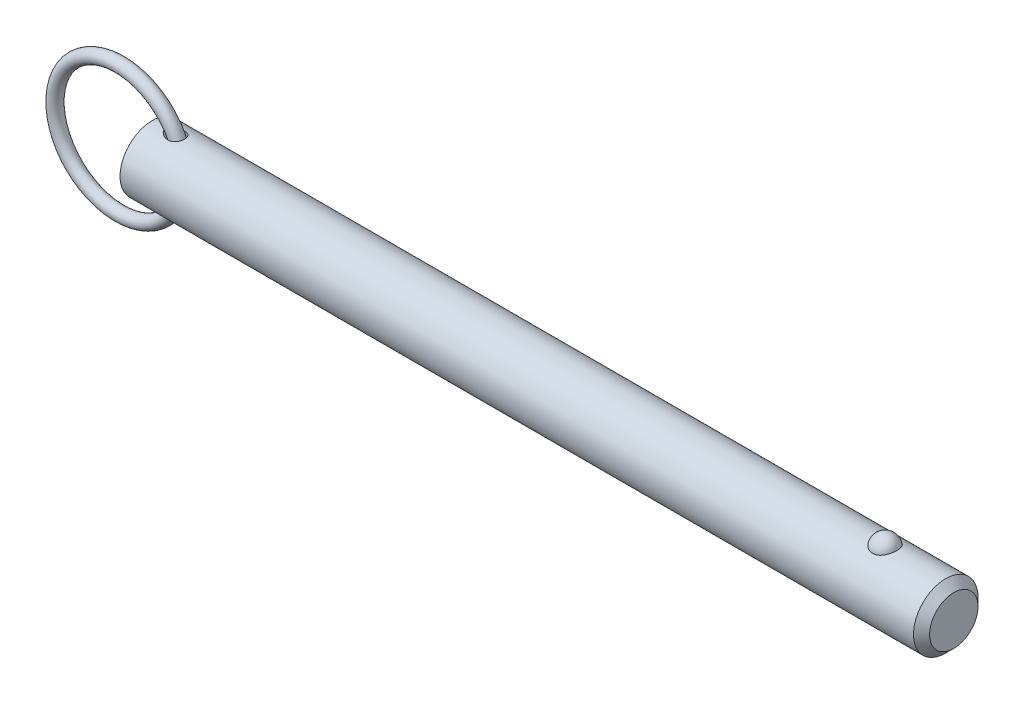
ISO-10303-21;
HEADER;
FILE_DESCRIPTION(('STEP AP214'),'2;1');
FILE_NAME('part.step','',(''),(''),'','','');
FILE_SCHEMA(('AUTOMOTIVE_DESIGN { 1 0 10303 214 1 1 1 1 }'));
ENDSEC;
DATA;
#1=APPLICATION_CONTEXT('core data for automotive mechanical design processes');
#2=APPLICATION_PROTOCOL_DEFINITION('international standard','automotive_design',2000,#1);
#3=PRODUCT_CONTEXT('',#1,'mechanical');
#4=PRODUCT('Part','Part','',(#3));
#5=PRODUCT_RELATED_PRODUCT_CATEGORY('part','',(#4));
#6=PRODUCT_DEFINITION_FORMATION('','',#4);
#7=PRODUCT_DEFINITION_CONTEXT('part definition',#1,'design');
#8=PRODUCT_DEFINITION('design','',#6,#7);
#9=PRODUCT_DEFINITION_SHAPE('','',#8);
#10=(LENGTH_UNIT() NAMED_UNIT(*) SI_UNIT(.MILLI.,.METRE.));
#11=(NAMED_UNIT(*) PLANE_ANGLE_UNIT() SI_UNIT($,.RADIAN.));
#12=(NAMED_UNIT(*) SI_UNIT($,.STERADIAN.) SOLID_ANGLE_UNIT());
#13=UNCERTAINTY_MEASURE_WITH_UNIT(LENGTH_MEASURE(1.E-05),#10,'distance_accuracy_value','');
#14=(GEOMETRIC_REPRESENTATION_CONTEXT(3) GLOBAL_UNCERTAINTY_ASSIGNED_CONTEXT((#13)) GLOBAL_UNIT_ASSIGNED_CONTEXT((#10,
#11,#12)) REPRESENTATION_CONTEXT('',''));
#15=CARTESIAN_POINT('',(0.,0.,0.));
#16=DIRECTION('',(0.,0.,1.));
#17=DIRECTION('',(1.,0.,0.));
#18=AXIS2_PLACEMENT_3D('',#15,#16,#17);
#19=CARTESIAN_POINT('',(-9.66825126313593,0.,0.));
#20=DIRECTION('',(0.,0.,1.));
#21=DIRECTION('',(1.,0.,0.));
#22=AXIS2_PLACEMENT_3D('',#19,#20,#21);
#23=TOROIDAL_SURFACE('',#22,19.05,1.905);
#24=CARTESIAN_POINT('',(11.2867487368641,0.,0.));
#25=VERTEX_POINT('',#24);
#26=VERTEX_LOOP('',#25);
#27=FACE_BOUND('',#26,.T.);
#28=ADVANCED_FACE('P0_F12',(#27),#23,.T.);
#29=CLOSED_SHELL('',(#28));
#30=MANIFOLD_SOLID_BREP('P0_B1',#29);
#31=CARTESIAN_POINT('',(0.,0.,0.));
#32=DIRECTION('',(1.,0.,0.));
#33=DIRECTION('',(0.,0.,-1.));
#34=AXIS2_PLACEMENT_3D('',#31,#32,#33);
#35=CYLINDRICAL_SURFACE('',#34,9.525);
#36=CARTESIAN_POINT('',(4.56693409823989,9.43141941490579,-1.33189820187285));
#37=CARTESIAN_POINT('',(4.70260475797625,9.41020313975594,-1.48215931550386));
#38=CARTESIAN_POINT('',(4.85555680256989,9.38755003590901,-1.61683982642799));
#39=CARTESIAN_POINT('',(5.10171959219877,9.35450554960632,-1.79512943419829));
#40=CARTESIAN_POINT('',(5.18674514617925,9.34362629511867,-1.85068909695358));
#41=CARTESIAN_POINT('',(5.3615438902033,9.32258514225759,-1.95392002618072));
#42=CARTESIAN_POINT('',(5.45131542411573,9.31242299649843,-2.00159402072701));
#43=CARTESIAN_POINT('',(5.70070211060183,9.28632120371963,-2.12033289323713));
#44=CARTESIAN_POINT('',(5.86420408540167,9.27146938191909,-2.18362944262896));
#45=CARTESIAN_POINT('',(6.19893345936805,9.24694163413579,-2.28525783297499));
#46=CARTESIAN_POINT('',(6.3701538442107,9.23726110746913,-2.32361187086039));
#47=CARTESIAN_POINT('',(6.73531776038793,9.22400982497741,-2.37575048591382));
#48=CARTESIAN_POINT('',(6.92975826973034,9.22118808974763,-2.38652934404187));
#49=CARTESIAN_POINT('',(7.21995443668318,9.22416297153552,-2.37494980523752));
#50=CARTESIAN_POINT('',(7.31643847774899,9.22635560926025,-2.366466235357));
#51=CARTESIAN_POINT('',(7.50796421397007,9.2331428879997,-2.33985028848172));
#52=CARTESIAN_POINT('',(7.6030065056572,9.23773650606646,-2.32172202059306));
#53=CARTESIAN_POINT('',(7.83273114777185,9.25183311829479,-2.26504721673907));
#54=CARTESIAN_POINT('',(7.96603028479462,9.26261470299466,-2.2209856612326));
#55=CARTESIAN_POINT('',(8.22310899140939,9.28816519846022,-2.1115730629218));
#56=CARTESIAN_POINT('',(8.34689477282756,9.30293147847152,-2.04623606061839));
#57=CARTESIAN_POINT('',(8.58136049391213,9.3349416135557,-1.89485344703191));
#58=CARTESIAN_POINT('',(8.69199721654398,9.35219324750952,-1.80874222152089));
#59=CARTESIAN_POINT('',(8.89592093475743,9.38707016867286,-1.61799188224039));
#60=CARTESIAN_POINT('',(8.98920771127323,9.40469546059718,-1.51335253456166));
#61=CARTESIAN_POINT('',(9.15057731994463,9.43713590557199,-1.29519427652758));
#62=CARTESIAN_POINT('',(9.21980158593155,9.45205440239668,-1.18253282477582));
#63=CARTESIAN_POINT('',(9.33826736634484,9.47856708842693,-0.946802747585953));
#64=CARTESIAN_POINT('',(9.38751161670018,9.49016173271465,-0.823735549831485));
#65=CARTESIAN_POINT('',(9.46423850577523,9.50859378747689,-0.57261402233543));
#66=CARTESIAN_POINT('',(9.49202393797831,9.5154972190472,-0.444656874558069));
#67=CARTESIAN_POINT('',(9.52636926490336,9.52406905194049,-0.185752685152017));
#68=CARTESIAN_POINT('',(9.53292923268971,9.52573747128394,-0.0548056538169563));
#69=CARTESIAN_POINT('',(9.52467276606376,9.52365852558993,0.20650329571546));
#70=CARTESIAN_POINT('',(9.50983454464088,9.51990564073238,0.336864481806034));
#71=CARTESIAN_POINT('',(9.45907362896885,9.50737852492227,0.593166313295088));
#72=CARTESIAN_POINT('',(9.42315106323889,9.49860432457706,0.719106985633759));
#73=CARTESIAN_POINT('',(9.3310664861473,9.4769892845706,0.96295935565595));
#74=CARTESIAN_POINT('',(9.27490839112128,9.46414923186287,1.08087260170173));
#75=CARTESIAN_POINT('',(9.14375803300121,9.43581000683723,1.30534632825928));
#76=CARTESIAN_POINT('',(9.06876720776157,9.42031103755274,1.41190767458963));
#77=CARTESIAN_POINT('',(8.90203187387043,9.38836719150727,1.61069439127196));
#78=CARTESIAN_POINT('',(8.81029913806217,9.37192298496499,1.70292975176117));
#79=CARTESIAN_POINT('',(8.6126877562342,9.33985045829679,1.87086859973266));
#80=CARTESIAN_POINT('',(8.50680947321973,9.3242221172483,1.94657251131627));
#81=CARTESIAN_POINT('',(8.28220546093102,9.29513431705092,2.08109032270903));
#82=CARTESIAN_POINT('',(8.16329919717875,9.28171415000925,2.13961034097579));
#83=CARTESIAN_POINT('',(7.91756052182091,9.25859072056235,2.23755716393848));
#84=CARTESIAN_POINT('',(7.79072606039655,9.24888842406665,2.27697900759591));
#85=CARTESIAN_POINT('',(7.52377913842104,9.23338749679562,2.33907806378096));
#86=CARTESIAN_POINT('',(7.3833476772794,9.22789571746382,2.36044900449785));
#87=CARTESIAN_POINT('',(7.1008139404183,9.22210229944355,2.3829751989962));
#88=CARTESIAN_POINT('',(6.95871103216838,9.22180269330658,2.38412253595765));
#89=CARTESIAN_POINT('',(6.65642691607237,9.22632724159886,2.36656230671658));
#90=CARTESIAN_POINT('',(6.49641694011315,9.23185415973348,2.3451317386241));
#91=CARTESIAN_POINT('',(6.18115433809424,9.24811737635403,2.28014143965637));
#92=CARTESIAN_POINT('',(6.02590710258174,9.25885936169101,2.23655754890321));
#93=CARTESIAN_POINT('',(5.69904720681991,9.28624254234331,2.12025087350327));
#94=CARTESIAN_POINT('',(5.52873601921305,9.30354853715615,2.04400672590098));
#95=CARTESIAN_POINT('',(5.20289495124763,9.34106989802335,1.86504730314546));
#96=CARTESIAN_POINT('',(5.0473596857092,9.36128419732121,1.76234172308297));
#97=CARTESIAN_POINT('',(4.79287124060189,9.39697639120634,1.55895334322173));
#98=CARTESIAN_POINT('',(4.6893870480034,9.41240250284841,1.46392900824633));
#99=CARTESIAN_POINT('',(4.4984714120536,9.44202586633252,1.25875918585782));
#100=CARTESIAN_POINT('',(4.41101129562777,9.45622528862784,1.1486413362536));
#101=CARTESIAN_POINT('',(4.27502257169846,9.47888210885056,0.940600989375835));
#102=CARTESIAN_POINT('',(4.22216329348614,9.48791121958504,0.845586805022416));
#103=CARTESIAN_POINT('',(4.13241478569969,9.50344321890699,0.648051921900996));
#104=CARTESIAN_POINT('',(4.0955118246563,9.50994827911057,0.545537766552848));
#105=CARTESIAN_POINT('',(4.04043124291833,9.51971586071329,0.334452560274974));
#106=CARTESIAN_POINT('',(4.02240728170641,9.52295176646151,0.225839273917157));
#107=CARTESIAN_POINT('',(4.00750873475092,9.52562364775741,0.00713006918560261));
#108=CARTESIAN_POINT('',(4.01062334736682,9.52506156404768,-0.102965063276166));
#109=CARTESIAN_POINT('',(4.03592967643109,9.52053221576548,-0.306944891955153));
#110=CARTESIAN_POINT('',(4.05571676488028,9.51699426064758,-0.401151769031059));
#111=CARTESIAN_POINT('',(4.10967975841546,9.5074546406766,-0.585176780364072));
#112=CARTESIAN_POINT('',(4.1438599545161,9.50145224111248,-0.674993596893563));
#113=CARTESIAN_POINT('',(4.23261356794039,9.48611703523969,-0.866116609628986));
#114=CARTESIAN_POINT('',(4.28990016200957,9.47635800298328,-0.966121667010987));
#115=CARTESIAN_POINT('',(4.4185657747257,9.45502867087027,-1.15640011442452));
#116=CARTESIAN_POINT('',(4.4899691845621,9.44345524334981,-1.24665623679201));
#117=CARTESIAN_POINT('',(4.56693409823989,9.43141941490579,-1.33189820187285));
#118=B_SPLINE_CURVE_WITH_KNOTS('',3,(#36,#37,#38,#39,#40,#41,#42,#43,#44,#45,#46,#47,#48,#49,
#50,#51,#52,#53,#54,#55,#56,#57,#58,#59,#60,#61,#62,#63,#64,#65,#66,#67,#68,#69,#70,#71,#72,#73,
#74,#75,#76,#77,#78,#79,#80,#81,#82,#83,#84,#85,#86,#87,#88,#89,#90,#91,#92,#93,#94,#95,#96,#97,
#98,#99,#100,#101,#102,#103,#104,#105,#106,#107,#108,#109,#110,#111,#112,#113,#114,#115,#116,
#117),.UNSPECIFIED.,.T.,.F.,(4,2,2,2,2,2,2,2,2,2,2,2,2,2,2,2,2,2,2,2,2,2,2,2,2,2,2,2,2,2,2,2,2,
2,2,2,2,2,2,2,4),(0.,0.609951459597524,0.916123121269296,1.22218863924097,1.74791337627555,
2.27316961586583,2.85362722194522,3.14383229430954,3.43391382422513,3.85437497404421,
4.27455920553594,4.69608835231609,5.11762282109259,5.5149005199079,5.91212379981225,
6.30363414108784,6.69514313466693,7.08705103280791,7.47895654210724,7.87078624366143,
8.26258603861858,8.65411137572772,9.04562666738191,9.44349251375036,9.84146165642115,
10.2662286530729,10.6911619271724,11.1739180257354,11.6572017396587,12.2170157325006,
12.7766249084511,13.1992556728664,13.6211226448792,13.9471990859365,14.2729943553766,
14.6014211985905,14.9296802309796,15.2173810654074,15.505167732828,15.8505863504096,
16.1966070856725),.UNSPECIFIED.);
#119=CARTESIAN_POINT('',(4.56693409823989,9.43141941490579,-1.33189820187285));
#120=VERTEX_POINT('',#119);
#121=EDGE_CURVE('P1_E40',#120,#120,#118,.T.);
#122=ORIENTED_EDGE('',*,*,#121,.T.);
#123=EDGE_LOOP('',(#122));
#124=FACE_BOUND('',#123,.T.);
#125=CARTESIAN_POINT('',(234.14875,0.,0.));
#126=DIRECTION('',(1.,0.,0.));
#127=DIRECTION('',(0.,0.,-1.));
#128=AXIS2_PLACEMENT_3D('',#125,#126,#127);
#129=CIRCLE('',#128,9.525);
#130=CARTESIAN_POINT('',(234.14875,0.,-9.525));
#131=VERTEX_POINT('',#130);
#132=EDGE_CURVE('P1_E25',#131,#131,#129,.T.);
#133=ORIENTED_EDGE('',*,*,#132,.F.);
#134=EDGE_LOOP('',(#133));
#135=FACE_BOUND('',#134,.T.);
#136=CARTESIAN_POINT('',(0.,0.,0.));
#137=DIRECTION('',(1.,0.,0.));
#138=DIRECTION('',(0.,0.,-1.));
#139=AXIS2_PLACEMENT_3D('',#136,#137,#138);
#140=CIRCLE('',#139,9.525);
#141=CARTESIAN_POINT('',(0.,0.,-9.525));
#142=VERTEX_POINT('',#141);
#143=EDGE_CURVE('P1_E9',#142,#142,#140,.T.);
#144=ORIENTED_EDGE('',*,*,#143,.T.);
#145=EDGE_LOOP('',(#144));
#146=FACE_BOUND('',#145,.T.);
#147=CARTESIAN_POINT('',(216.245757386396,8.80405803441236,3.63513233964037));
#148=CARTESIAN_POINT('',(216.151676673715,8.80405953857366,3.63513053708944));
#149=CARTESIAN_POINT('',(216.057561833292,8.80561325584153,3.63137461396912));
#150=CARTESIAN_POINT('',(215.870012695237,8.81177748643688,3.616386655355));
#151=CARTESIAN_POINT('',(215.776578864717,8.81638992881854,3.60514990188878));
#152=CARTESIAN_POINT('',(215.497945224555,8.83467114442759,3.56024627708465));
#153=CARTESIAN_POINT('',(215.314691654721,8.85278327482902,3.51538626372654));
#154=CARTESIAN_POINT('',(214.959509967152,8.89871214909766,3.39742145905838));
#155=CARTESIAN_POINT('',(214.787553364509,8.9265032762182,3.32439116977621));
#156=CARTESIAN_POINT('',(214.458707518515,8.98874819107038,3.15220244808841));
#157=CARTESIAN_POINT('',(214.301811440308,9.02319893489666,3.053055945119));
#158=CARTESIAN_POINT('',(214.002214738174,9.0962918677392,2.82797815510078));
#159=CARTESIAN_POINT('',(213.860060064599,9.13502685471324,2.70135138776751));
#160=CARTESIAN_POINT('',(213.598299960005,9.21186572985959,2.42641932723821));
#161=CARTESIAN_POINT('',(213.478701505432,9.2499694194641,2.27810735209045));
#162=CARTESIAN_POINT('',(213.259645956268,9.3234108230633,1.95652290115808));
#163=CARTESIAN_POINT('',(213.161317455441,9.35855090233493,1.78243511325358));
#164=CARTESIAN_POINT('',(212.993819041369,9.42045142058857,1.41937246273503));
#165=CARTESIAN_POINT('',(212.924651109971,9.44721128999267,1.23039658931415));
#166=CARTESIAN_POINT('',(212.816199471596,9.48990641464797,0.840370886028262));
#167=CARTESIAN_POINT('',(212.777288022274,9.50570658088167,0.639202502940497));
#168=CARTESIAN_POINT('',(212.731555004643,9.52433146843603,0.232664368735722));
#169=CARTESIAN_POINT('',(212.724732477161,9.52715657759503,0.0272947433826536));
#170=CARTESIAN_POINT('',(212.743255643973,9.51956918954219,-0.380478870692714));
#171=CARTESIAN_POINT('',(212.768405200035,9.50923740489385,-0.582893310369));
#172=CARTESIAN_POINT('',(212.85002537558,9.47651897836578,-0.98029399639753));
#173=CARTESIAN_POINT('',(212.906496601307,9.45413210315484,-1.17528009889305));
#174=CARTESIAN_POINT('',(213.049719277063,9.39954044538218,-1.55263697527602));
#175=CARTESIAN_POINT('',(213.136512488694,9.36732213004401,-1.73498993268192));
#176=CARTESIAN_POINT('',(213.338610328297,9.29640700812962,-2.08177763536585));
#177=CARTESIAN_POINT('',(213.453917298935,9.25770966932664,-2.24621090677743));
#178=CARTESIAN_POINT('',(213.711264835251,9.17775604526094,-2.55338333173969));
#179=CARTESIAN_POINT('',(213.853434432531,9.136488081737,-2.69601150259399));
#180=CARTESIAN_POINT('',(214.16089985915,9.05620497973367,-2.95451229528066));
#181=CARTESIAN_POINT('',(214.326193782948,9.01718965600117,-3.07038711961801));
#182=CARTESIAN_POINT('',(214.672052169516,8.9468001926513,-3.26976836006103));
#183=CARTESIAN_POINT('',(214.852227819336,8.91528408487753,-3.35389750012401));
#184=CARTESIAN_POINT('',(215.225651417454,8.86272514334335,-3.49043503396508));
#185=CARTESIAN_POINT('',(215.418894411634,8.8416783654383,-3.54285537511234));
#186=CARTESIAN_POINT('',(215.802503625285,8.81348056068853,-3.61241306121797));
#187=CARTESIAN_POINT('',(215.992525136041,8.80568348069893,-3.63119339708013));
#188=CARTESIAN_POINT('',(216.373190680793,8.80289410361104,-3.6379534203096));
#189=CARTESIAN_POINT('',(216.563834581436,8.8078992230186,-3.6259393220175));
#190=CARTESIAN_POINT('',(216.934007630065,8.82974915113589,-3.57238430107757));
#191=CARTESIAN_POINT('',(217.113697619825,8.84621463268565,-3.53178890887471));
#192=CARTESIAN_POINT('',(217.463422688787,8.88875330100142,-3.42331083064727));
#193=CARTESIAN_POINT('',(217.633456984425,8.91482726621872,-3.35542593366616));
#194=CARTESIAN_POINT('',(217.963237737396,8.97448239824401,-3.19248225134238));
#195=CARTESIAN_POINT('',(218.122680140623,9.00821446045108,-3.09686474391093));
#196=CARTESIAN_POINT('',(218.423513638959,9.0793539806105,-2.88162736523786));
#197=CARTESIAN_POINT('',(218.564900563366,9.11676228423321,-2.76200196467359));
#198=CARTESIAN_POINT('',(218.83331931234,9.19347419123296,-2.49516285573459));
#199=CARTESIAN_POINT('',(218.959275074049,9.23277872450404,-2.34686614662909));
#200=CARTESIAN_POINT('',(219.185522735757,9.30737610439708,-2.03093683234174));
#201=CARTESIAN_POINT('',(219.28581004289,9.34266823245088,-1.86330077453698));
#202=CARTESIAN_POINT('',(219.461514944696,9.40674710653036,-1.50744893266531));
#203=CARTESIAN_POINT('',(219.536041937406,9.4352917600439,-1.31874876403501));
#204=CARTESIAN_POINT('',(219.65416505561,9.4814413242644,-0.930631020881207));
#205=CARTESIAN_POINT('',(219.697760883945,9.49904612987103,-0.731213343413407));
#206=CARTESIAN_POINT('',(219.753158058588,9.5215314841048,-0.327147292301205));
#207=CARTESIAN_POINT('',(219.764935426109,9.52640243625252,-0.122495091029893));
#208=CARTESIAN_POINT('',(219.756382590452,9.52289571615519,0.286018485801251));
#209=CARTESIAN_POINT('',(219.73605305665,9.51451832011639,0.48987987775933));
#210=CARTESIAN_POINT('',(219.663884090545,9.48544083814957,0.889994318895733));
#211=CARTESIAN_POINT('',(219.612199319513,9.46480124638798,1.08627971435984));
#212=CARTESIAN_POINT('',(219.478491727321,9.4133389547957,1.46682086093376));
#213=CARTESIAN_POINT('',(219.396466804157,9.38251554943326,1.65107577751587));
#214=CARTESIAN_POINT('',(219.20319292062,9.31365636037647,2.00346348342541));
#215=CARTESIAN_POINT('',(219.091783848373,9.27558138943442,2.17150083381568));
#216=CARTESIAN_POINT('',(218.842294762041,9.19638714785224,2.48563115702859));
#217=CARTESIAN_POINT('',(218.704216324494,9.15526805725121,2.63172542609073));
#218=CARTESIAN_POINT('',(218.404843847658,9.07465393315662,2.89750997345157));
#219=CARTESIAN_POINT('',(218.243610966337,9.03515496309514,3.01726776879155));
#220=CARTESIAN_POINT('',(217.901613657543,8.96227564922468,3.22732920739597));
#221=CARTESIAN_POINT('',(217.720841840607,8.92889763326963,3.31762165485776));
#222=CARTESIAN_POINT('',(217.351445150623,8.87345380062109,3.46314419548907));
#223=CARTESIAN_POINT('',(217.16332371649,8.85102983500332,3.51950082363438));
#224=CARTESIAN_POINT('',(216.87578699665,8.82666967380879,3.57993683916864));
#225=CARTESIAN_POINT('',(216.779133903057,8.82009725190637,3.59606217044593));
#226=CARTESIAN_POINT('',(216.584677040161,8.81020897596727,3.62022512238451));
#227=CARTESIAN_POINT('',(216.48687410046,8.80689090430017,3.62826825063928));
#228=CARTESIAN_POINT('',(216.341224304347,8.80445615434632,3.63416760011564));
#229=CARTESIAN_POINT('',(216.293495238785,8.80405727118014,3.63513325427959));
#230=CARTESIAN_POINT('',(216.245757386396,8.80405803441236,3.63513233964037));
#231=B_SPLINE_CURVE_WITH_KNOTS('',3,(#147,#148,#149,#150,#151,#152,#153,#154,#155,#156,#157,
#158,#159,#160,#161,#162,#163,#164,#165,#166,#167,#168,#169,#170,#171,#172,#173,#174,#175,#176,
#177,#178,#179,#180,#181,#182,#183,#184,#185,#186,#187,#188,#189,#190,#191,#192,#193,#194,#195,
#196,#197,#198,#199,#200,#201,#202,#203,#204,#205,#206,#207,#208,#209,#210,#211,#212,#213,#214,
#215,#216,#217,#218,#219,#220,#221,#222,#223,#224,#225,#226,#227,#228,#229,#230),.UNSPECIFIED.,
.T.,.F.,(4,2,2,2,2,2,2,2,2,2,2,2,2,2,2,2,2,2,2,2,2,2,2,2,2,2,2,2,2,2,2,2,2,2,2,2,2,2,2,2,2,4),
(0.,0.282202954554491,0.564584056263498,1.13017050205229,1.69427128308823,2.25811483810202,
2.83836627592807,3.41879688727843,4.02497117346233,4.63118665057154,5.24474754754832,
5.85829010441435,6.46808687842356,7.07789545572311,7.68854723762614,8.29924920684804,
8.91296283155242,9.52662591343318,10.1275338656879,10.7282152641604,11.2986646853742,
11.868998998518,12.4213015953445,12.9736489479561,13.5380053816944,14.1024919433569,
14.6952986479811,15.2882113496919,15.8999469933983,16.5116885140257,17.1238909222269,
17.7360805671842,18.3452748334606,18.9545113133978,19.5671386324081,20.1797297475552,
20.7907316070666,21.4019653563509,21.9915938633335,22.2859053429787,22.580016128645,
22.7232098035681),.UNSPECIFIED.);
#232=CARTESIAN_POINT('',(216.245757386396,8.80405803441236,3.63513233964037));
#233=VERTEX_POINT('',#232);
#234=EDGE_CURVE('P1_E34',#233,#233,#231,.T.);
#235=ORIENTED_EDGE('',*,*,#234,.T.);
#236=EDGE_LOOP('',(#235));
#237=FACE_BOUND('',#236,.T.);
#238=CARTESIAN_POINT('',(4.56693409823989,-9.43141941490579,-1.33189820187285));
#239=CARTESIAN_POINT('',(4.48932984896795,-9.4435553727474,-1.24594548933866));
#240=CARTESIAN_POINT('',(4.41737309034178,-9.45522193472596,-1.1548795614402));
#241=CARTESIAN_POINT('',(4.28781047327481,-9.47670896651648,-0.962782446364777));
#242=CARTESIAN_POINT('',(4.23019403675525,-9.48653079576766,-0.861758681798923));
#243=CARTESIAN_POINT('',(4.132545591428,-9.5034118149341,-0.649723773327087));
#244=CARTESIAN_POINT('',(4.09271158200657,-9.51043980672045,-0.538615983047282));
#245=CARTESIAN_POINT('',(4.04973167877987,-9.51806966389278,-0.367764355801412));
#246=CARTESIAN_POINT('',(4.03820037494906,-9.52012756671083,-0.310118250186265));
#247=CARTESIAN_POINT('',(4.02100287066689,-9.52320274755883,-0.193935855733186));
#248=CARTESIAN_POINT('',(4.01533565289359,-9.52422020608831,-0.135399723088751));
#249=CARTESIAN_POINT('',(4.0081707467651,-9.52550497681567,0.0247266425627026));
#250=CARTESIAN_POINT('',(4.0127049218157,-9.52468821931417,0.126661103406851));
#251=CARTESIAN_POINT('',(4.03954973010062,-9.51988506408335,0.328012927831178));
#252=CARTESIAN_POINT('',(4.06186450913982,-9.51589792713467,0.42742969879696));
#253=CARTESIAN_POINT('',(4.12088980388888,-9.5054852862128,0.616362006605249));
#254=CARTESIAN_POINT('',(4.15684838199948,-9.49918763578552,0.706123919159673));
#255=CARTESIAN_POINT('',(4.24094647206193,-9.48470618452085,0.879522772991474));
#256=CARTESIAN_POINT('',(4.28909090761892,-9.47652162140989,0.96315722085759));
#257=CARTESIAN_POINT('',(4.42295891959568,-9.45426317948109,1.16513741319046));
#258=CARTESIAN_POINT('',(4.51523752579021,-9.43933320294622,1.27905352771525));
#259=CARTESIAN_POINT('',(4.71682295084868,-9.40825940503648,1.49055892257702));
#260=CARTESIAN_POINT('',(4.82617286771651,-9.39211256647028,1.58810554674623));
#261=CARTESIAN_POINT('',(5.09064226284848,-9.35555264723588,1.79246125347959));
#262=CARTESIAN_POINT('',(5.2499041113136,-9.33524115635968,1.89393122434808));
#263=CARTESIAN_POINT('',(5.58309255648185,-9.29785396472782,2.06968659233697));
#264=CARTESIAN_POINT('',(5.75702897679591,-9.28078045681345,2.14395359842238));
#265=CARTESIAN_POINT('',(6.11646882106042,-9.25213303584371,2.26440412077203));
#266=CARTESIAN_POINT('',(6.30205582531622,-9.2406056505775,2.31035092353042));
#267=CARTESIAN_POINT('',(6.67856093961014,-9.22541807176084,2.37029728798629));
#268=CARTESIAN_POINT('',(6.8694704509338,-9.2217458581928,2.3843456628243));
#269=CARTESIAN_POINT('',(7.21217144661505,-9.22344239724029,2.37775005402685));
#270=CARTESIAN_POINT('',(7.36409439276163,-9.22713860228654,2.36352577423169));
#271=CARTESIAN_POINT('',(7.66346227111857,-9.24048072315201,2.31082299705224));
#272=CARTESIAN_POINT('',(7.81090958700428,-9.25012341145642,2.27235765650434));
#273=CARTESIAN_POINT('',(8.09730316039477,-9.2746609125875,2.17003648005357));
#274=CARTESIAN_POINT('',(8.2361965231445,-9.28958517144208,2.10603803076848));
#275=CARTESIAN_POINT('',(8.49918675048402,-9.32290326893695,1.95324442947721));
#276=CARTESIAN_POINT('',(8.62328895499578,-9.34129584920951,1.86445826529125));
#277=CARTESIAN_POINT('',(8.84006515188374,-9.37706953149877,1.67466761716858));
#278=CARTESIAN_POINT('',(8.93465172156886,-9.39436331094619,1.57582357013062));
#279=CARTESIAN_POINT('',(9.10490234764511,-9.42761680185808,1.362809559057));
#280=CARTESIAN_POINT('',(9.18057146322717,-9.44357686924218,1.24864370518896));
#281=CARTESIAN_POINT('',(9.30789178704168,-9.47159985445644,1.01379272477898));
#282=CARTESIAN_POINT('',(9.36045544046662,-9.48380365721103,0.893617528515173));
#283=CARTESIAN_POINT('',(9.44498362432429,-9.50388751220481,0.645890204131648));
#284=CARTESIAN_POINT('',(9.47694947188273,-9.51176784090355,0.518338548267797));
#285=CARTESIAN_POINT('',(9.51944262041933,-9.52232073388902,0.260103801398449));
#286=CARTESIAN_POINT('',(9.53006646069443,-9.52501674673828,0.129437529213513));
#287=CARTESIAN_POINT('',(9.52993291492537,-9.52498309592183,-0.131885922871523));
#288=CARTESIAN_POINT('',(9.51917525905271,-9.52225336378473,-0.26254310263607));
#289=CARTESIAN_POINT('',(9.47648788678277,-9.51165418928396,-0.520312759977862));
#290=CARTESIAN_POINT('',(9.44453086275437,-9.50377811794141,-0.647420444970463));
#291=CARTESIAN_POINT('',(9.36015568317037,-9.48373425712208,-0.89429087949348));
#292=CARTESIAN_POINT('',(9.30773827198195,-9.47156662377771,-1.01405389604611));
#293=CARTESIAN_POINT('',(9.1838089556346,-9.44428888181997,-1.24269386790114));
#294=CARTESIAN_POINT('',(9.11232064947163,-9.42918241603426,-1.3515840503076));
#295=CARTESIAN_POINT('',(8.9521268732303,-9.39767706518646,-1.55562459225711));
#296=CARTESIAN_POINT('',(8.86342281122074,-9.3812782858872,-1.65077607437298));
#297=CARTESIAN_POINT('',(8.6710444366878,-9.34891827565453,-1.82517515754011));
#298=CARTESIAN_POINT('',(8.56732858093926,-9.33295841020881,-1.90437711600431));
#299=CARTESIAN_POINT('',(8.34818438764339,-9.30317889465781,-2.0449122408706));
#300=CARTESIAN_POINT('',(8.23275529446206,-9.28935938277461,-2.10624425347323));
#301=CARTESIAN_POINT('',(7.98961240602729,-9.26475003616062,-2.2120340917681));
#302=CARTESIAN_POINT('',(7.86162088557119,-9.25407358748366,-2.25587700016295));
#303=CARTESIAN_POINT('',(7.60027499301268,-9.23720810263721,-2.32397032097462));
#304=CARTESIAN_POINT('',(7.46691858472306,-9.23102078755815,-2.34821321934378));
#305=CARTESIAN_POINT('',(7.18516230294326,-9.22302718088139,-2.37943079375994));
#306=CARTESIAN_POINT('',(7.03654454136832,-9.22169704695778,-2.38452997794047));
#307=CARTESIAN_POINT('',(6.74015049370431,-9.22442327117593,-2.37395141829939));
#308=CARTESIAN_POINT('',(6.59237455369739,-9.22848170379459,-2.35826567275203));
#309=CARTESIAN_POINT('',(6.27762777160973,-9.2422287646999,-2.30385559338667));
#310=CARTESIAN_POINT('',(6.11124715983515,-9.25269504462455,-2.26192683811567));
#311=CARTESIAN_POINT('',(5.78635920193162,-9.27830776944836,-2.15445569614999));
#312=CARTESIAN_POINT('',(5.62786567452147,-9.29346211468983,-2.08887341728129));
#313=CARTESIAN_POINT('',(5.39013065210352,-9.31931237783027,-1.96924953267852));
#314=CARTESIAN_POINT('',(5.30683088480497,-9.32901725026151,-1.92292485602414));
#315=CARTESIAN_POINT('',(5.1445580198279,-9.34899035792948,-1.82334419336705));
#316=CARTESIAN_POINT('',(5.06558607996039,-9.35925874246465,-1.77008636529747));
#317=CARTESIAN_POINT('',(4.83670950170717,-9.39034445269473,-1.60010986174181));
#318=CARTESIAN_POINT('',(4.69422471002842,-9.41151337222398,-1.47288240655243));
#319=CARTESIAN_POINT('',(4.56693409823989,-9.43141941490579,-1.33189820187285));
#320=B_SPLINE_CURVE_WITH_KNOTS('',3,(#238,#239,#240,#241,#242,#243,#244,#245,#246,#247,#248,
#249,#250,#251,#252,#253,#254,#255,#256,#257,#258,#259,#260,#261,#262,#263,#264,#265,#266,#267,
#268,#269,#270,#271,#272,#273,#274,#275,#276,#277,#278,#279,#280,#281,#282,#283,#284,#285,#286,
#287,#288,#289,#290,#291,#292,#293,#294,#295,#296,#297,#298,#299,#300,#301,#302,#303,#304,#305,
#306,#307,#308,#309,#310,#311,#312,#313,#314,#315,#316,#317,#318,#319),.UNSPECIFIED.,.T.,.F.,(4,
2,2,2,2,2,2,2,2,2,2,2,2,2,2,2,2,2,2,2,2,2,2,2,2,2,2,2,2,2,2,2,2,2,2,2,2,2,2,2,4),(0.,
0.348900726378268,0.697543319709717,1.0499765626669,1.22617690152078,1.40234666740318,
1.70666745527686,2.01105922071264,2.30066493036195,2.59038784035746,3.03001384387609,
3.4707682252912,4.03766594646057,4.60494622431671,5.17690598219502,5.74798989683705,
6.20400848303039,6.65977977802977,7.11813321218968,7.57632066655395,7.98791759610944,
8.39940433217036,8.7927345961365,9.18603970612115,9.577561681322,9.9690885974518,
10.3611208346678,10.7531388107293,11.1446739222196,11.536177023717,11.9287850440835,
12.3214184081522,12.7268448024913,13.1324265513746,13.5768390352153,14.0214226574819,
14.5351685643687,15.0497849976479,15.3368801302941,15.6240516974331,16.1963372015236),.UNSPECIFIED.);
#321=CARTESIAN_POINT('',(4.56693409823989,-9.43141941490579,-1.33189820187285));
#322=VERTEX_POINT('',#321);
#323=EDGE_CURVE('P1_E17',#322,#322,#320,.T.);
#324=ORIENTED_EDGE('',*,*,#323,.T.);
#325=EDGE_LOOP('',(#324));
#326=FACE_BOUND('',#325,.T.);
#327=ADVANCED_FACE('P1_F13',(#124,#135,#146,#237,#326),#35,.T.);
#328=CARTESIAN_POINT('',(0.,0.,0.));
#329=DIRECTION('',(-1.,0.,0.));
#330=DIRECTION('',(0.,0.,1.));
#331=AXIS2_PLACEMENT_3D('',#328,#329,#330);
#332=PLANE('',#331);
#333=ORIENTED_EDGE('',*,*,#143,.F.);
#334=EDGE_LOOP('',(#333));
#335=FACE_BOUND('',#334,.T.);
#336=ADVANCED_FACE('P1_F15',(#335),#332,.T.);
#337=CARTESIAN_POINT('',(236.53,0.,0.));
#338=DIRECTION('',(-1.,0.,0.));
#339=DIRECTION('',(0.,0.,1.));
#340=AXIS2_PLACEMENT_3D('',#337,#338,#339);
#341=CONICAL_SURFACE('',#340,7.14375000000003,0.785398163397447);
#342=ORIENTED_EDGE('',*,*,#132,.T.);
#343=EDGE_LOOP('',(#342));
#344=FACE_BOUND('',#343,.T.);
#345=CARTESIAN_POINT('',(236.53,0.,0.));
#346=DIRECTION('',(1.,0.,0.));
#347=DIRECTION('',(0.,0.,-1.));
#348=AXIS2_PLACEMENT_3D('',#345,#346,#347);
#349=CIRCLE('',#348,7.14375000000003);
#350=CARTESIAN_POINT('',(236.53,0.,-7.14375000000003));
#351=VERTEX_POINT('',#350);
#352=EDGE_CURVE('P1_E30',#351,#351,#349,.T.);
#353=ORIENTED_EDGE('',*,*,#352,.F.);
#354=EDGE_LOOP('',(#353));
#355=FACE_BOUND('',#354,.T.);
#356=ADVANCED_FACE('P1_F55',(#344,#355),#341,.T.);
#357=CARTESIAN_POINT('',(236.53,7.14375000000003,0.));
#358=DIRECTION('',(1.,0.,0.));
#359=DIRECTION('',(0.,0.,-1.));
#360=AXIS2_PLACEMENT_3D('',#357,#358,#359);
#361=PLANE('',#360);
#362=ORIENTED_EDGE('',*,*,#352,.T.);
#363=EDGE_LOOP('',(#362));
#364=FACE_BOUND('',#363,.T.);
#365=ADVANCED_FACE('P1_F51',(#364),#361,.T.);
#366=CARTESIAN_POINT('',(216.245757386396,8.57249999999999,0.));
#367=DIRECTION('',(-1.,0.,0.));
#368=DIRECTION('',(0.,1.,0.));
#369=AXIS2_PLACEMENT_3D('',#366,#367,#368);
#370=SPHERICAL_SURFACE('',#369,3.64250000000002);
#371=ORIENTED_EDGE('',*,*,#234,.F.);
#372=EDGE_LOOP('',(#371));
#373=FACE_BOUND('',#372,.T.);
#374=ADVANCED_FACE('P1_F46',(#373),#370,.T.);
#375=CARTESIAN_POINT('',(-9.66825126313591,0.,0.));
#376=DIRECTION('',(0.,0.,1.));
#377=DIRECTION('',(1.,0.,0.));
#378=AXIS2_PLACEMENT_3D('',#375,#376,#377);
#379=TOROIDAL_SURFACE('',#378,19.05,2.38125);
#380=ORIENTED_EDGE('',*,*,#323,.F.);
#381=EDGE_LOOP('',(#380));
#382=FACE_BOUND('',#381,.T.);
#383=ORIENTED_EDGE('',*,*,#121,.F.);
#384=EDGE_LOOP('',(#383));
#385=FACE_BOUND('',#384,.T.);
#386=ADVANCED_FACE('P1_F50',(#382,#385),#379,.F.);
#387=CLOSED_SHELL('',(#327,#336,#356,#365,#374,#386));
#388=MANIFOLD_SOLID_BREP('P1_B1',#387);
#389=ADVANCED_BREP_SHAPE_REPRESENTATION('',(#18,#30,#388),#14);
#390=SHAPE_DEFINITION_REPRESENTATION(#9,#389);
ENDSEC;
END-ISO-10303-21;
